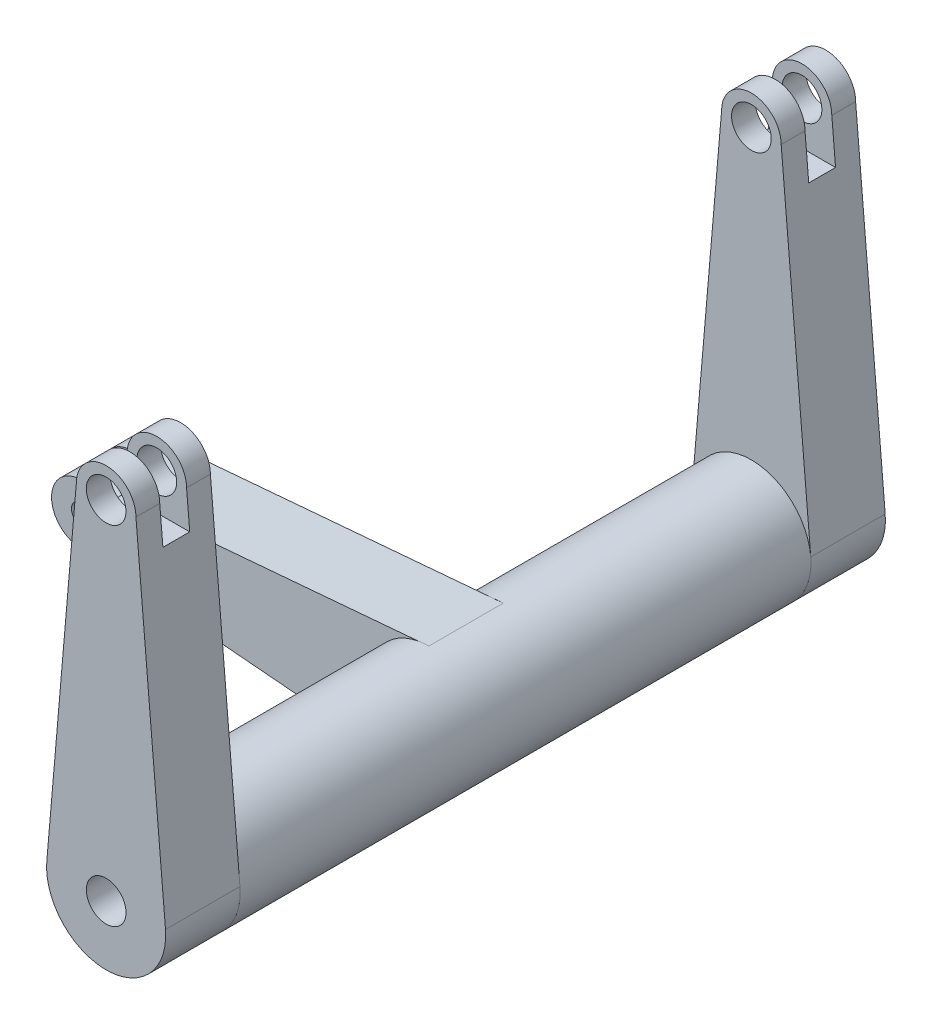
from build123d import *
from build123d.topology import SkipClean

# Parameters (mm, degrees)
SKETCH1_R               = 2.54
EXTRUDE1_DEPTH          = 9.525
CUT_EXTRUDE1_DEPTH      = 6.35
CUT_EXTRUDE1_DEPTH_BACK = 19.05
SKETCH3_W               = 6.858
SKETCH3_H               = 25.4
EXTRUDE2_START          = 63.5
SKETCH4_R               = 15.24
EXTRUDE2_DEPTH          = 63.5
SKETCH5_R               = 15.24
EXTRUDE3_DEPTH          = 63.5
EXTRUDE4_DEPTH          = 19.05
EXTRUDE5_START          = 19.05
EXTRUDE5_DEPTH          = 19.05
SKETCH9_R               = 5.08
EXTRUDE6_DEPTH          = 282.814247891
SKETCH10_R              = 5.08
EXTRUDE7_DEPTH          = 282.814247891
SKETCH11_W              = 6.858
SKETCH11_H              = 25.4
EXTRUDE9_DEPTH          = 233.348560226


with BuildPart() as part:
    # Sketch1 → Extrude1 (new, symmetric)
    with BuildSketch(Plane.XY):
        with BuildLine():
            Line((0, -163.319773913), (88.9, -155.699773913))
            ThreePointArc((88.9, -155.699773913), (104.14, -170.939773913), (88.9, -186.179773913))
            Line((88.9, -186.179773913), (0, -178.559773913))
            ThreePointArc((0, -178.559773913), (-7.62, -170.939773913), (0, -163.319773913))
        make_face()
        with Locations(Location((0, -170.939773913, 0), (0, 0, 180))):
            Circle(SKETCH1_R, mode=Mode.SUBTRACT)
    extrude(amount=EXTRUDE1_DEPTH, both=True)

    # Sketch3 → Cut-Extrude1 (cut, two sides: drawn at the far end of the back side and taken through both)
    with BuildSketch(Plane(origin=(0, 0, 0), x_dir=(0, 0, -1), z_dir=(1, 0, 0)).offset(-CUT_EXTRUDE1_DEPTH_BACK)):
        with Locations((0, -170.757189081)):
            Rectangle(SKETCH3_W, SKETCH3_H)
    extrude(amount=CUT_EXTRUDE1_DEPTH + CUT_EXTRUDE1_DEPTH_BACK, mode=Mode.SUBTRACT)

    # Sketch4 → Extrude2 (add)
    with SkipClean():  # the faces are left unmerged after this step: merging them gives an invalid solid
        with BuildSketch(Plane.XY.offset(9.525).offset(EXTRUDE2_START)):
            with Locations(Location((88.9, -170.939773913, 0), (0, 0, 260.201815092))):
                Circle(SKETCH4_R)
        extrude(amount=-EXTRUDE2_DEPTH)

    # Sketch5 → Extrude3 (add)
    with SkipClean():  # the faces are left unmerged after this step: merging them gives an invalid solid
        with BuildSketch(Plane(origin=(0, 0, -9.525), x_dir=(-1, 0, 0), z_dir=(0, 0, -1))):
            with Locations((-88.9, -170.939773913)):
                Circle(SKETCH5_R)
        extrude(amount=EXTRUDE3_DEPTH)

    # Sketch7 → Extrude4 (add)
    with SkipClean():  # the faces are left unmerged after this step: merging them gives an invalid solid
        with BuildSketch(Plane.XY.offset(73.025)):
            with BuildLine():
                Line((81.28, -82.039773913), (73.71672728, -169.628703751))
                ThreePointArc((73.71672728, -169.628703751), (88.9, -186.179546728), (104.08327272, -169.628703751))
                Line((104.08327272, -169.628703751), (96.52, -82.039773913))
                ThreePointArc((96.52, -82.039773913), (88.9, -74.419773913), (81.28, -82.039773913))
            make_face()
        extrude(amount=EXTRUDE4_DEPTH)

    # Sketch8 → Extrude5 (add)
    with SkipClean():  # the faces are left unmerged after this step: merging them gives an invalid solid
        with BuildSketch(Plane(origin=(0, 0, -73.025), x_dir=(-1, 0, 0), z_dir=(0, 0, -1)).offset(EXTRUDE5_START)):
            with BuildLine():
                Line((-73.71672728, -169.628703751), (-81.28, -82.039773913))
                ThreePointArc((-81.28, -82.039773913), (-88.9, -74.419773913), (-96.52, -82.039773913))
                Line((-96.52, -82.039773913), (-104.08327272, -169.628703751))
                ThreePointArc((-104.08327272, -169.628703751), (-88.9, -186.179546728), (-73.71672728, -169.628703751))
            make_face()
        extrude(amount=-EXTRUDE5_DEPTH)

    # Sketch9 → Extrude6 (cut, through all)
    with SkipClean():  # the faces are left unmerged after this step: merging them gives an invalid solid
        with BuildSketch(Plane(origin=(0, 0, -92.075), x_dir=(-1, 0, 0), z_dir=(0, 0, -1))):
            with Locations((-88.9, -82.039773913)):
                Circle(SKETCH9_R)
        extrude(amount=-EXTRUDE6_DEPTH, mode=Mode.SUBTRACT)

    # Sketch10 → Extrude7 (cut, through all)
    with SkipClean():  # the faces are left unmerged after this step: merging them gives an invalid solid
        with BuildSketch(Plane(origin=(0, 0, -92.075), x_dir=(-1, 0, 0), z_dir=(0, 0, -1))):
            with Locations((-88.9, -170.939773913)):
                Circle(SKETCH10_R)
        extrude(amount=-EXTRUDE7_DEPTH, mode=Mode.SUBTRACT)

    # Sketch11 → Extrude9 (cut, through all)
    with SkipClean():  # the faces are left unmerged after this step: merging them gives an invalid solid
        with BuildSketch(Plane(origin=(0, 0, 0), x_dir=(0, 0, -1), z_dir=(1, 0, 0))):
            with Locations((-82.55, -78.676033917)):
                Rectangle(SKETCH11_W, SKETCH11_H)
            with Locations((82.55, -80.406885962)):
                Rectangle(SKETCH11_W, SKETCH11_H)
        extrude(amount=EXTRUDE9_DEPTH, mode=Mode.SUBTRACT)


solid = part.part
